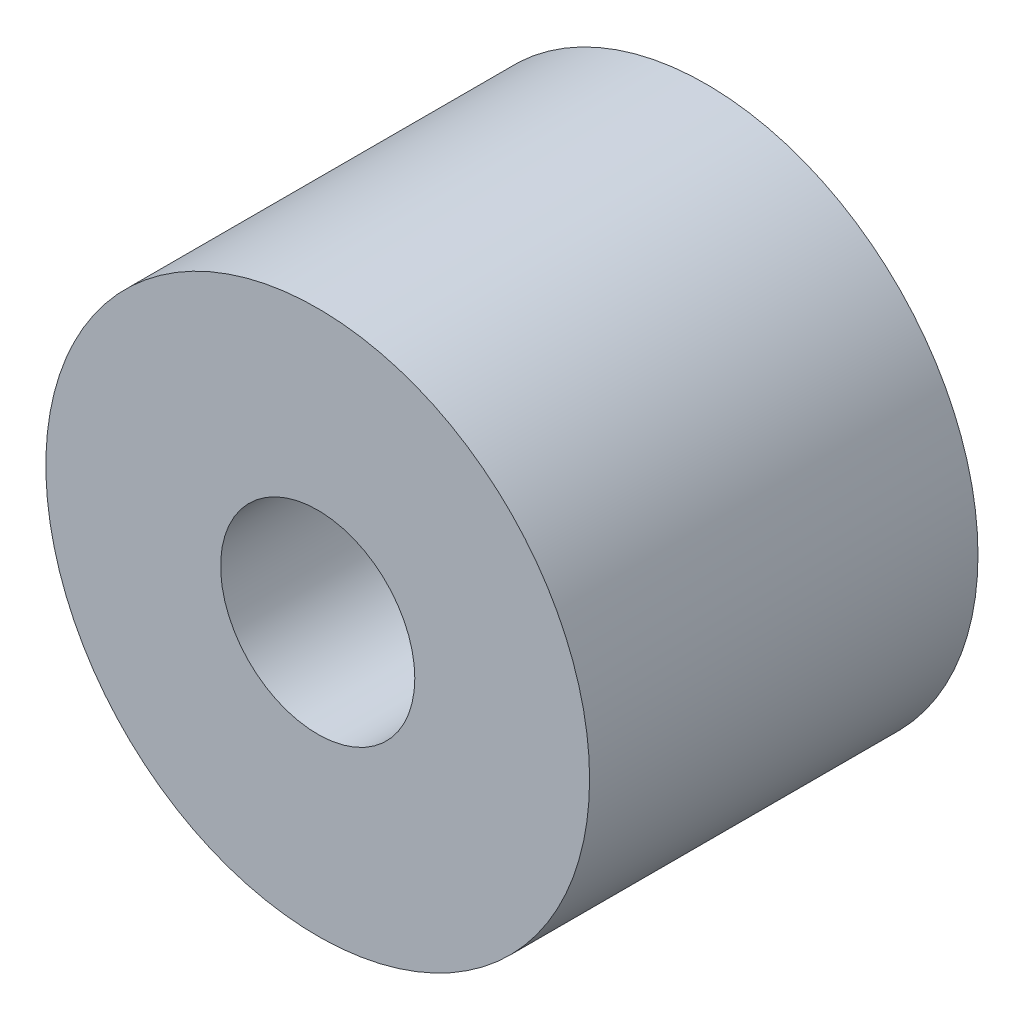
ISO-10303-21;
HEADER;
FILE_DESCRIPTION(('STEP AP214'),'2;1');
FILE_NAME('part.step','',(''),(''),'','','');
FILE_SCHEMA(('AUTOMOTIVE_DESIGN { 1 0 10303 214 1 1 1 1 }'));
ENDSEC;
DATA;
#1=APPLICATION_CONTEXT('core data for automotive mechanical design processes');
#2=APPLICATION_PROTOCOL_DEFINITION('international standard','automotive_design',2000,#1);
#3=PRODUCT_CONTEXT('',#1,'mechanical');
#4=PRODUCT('Part','Part','',(#3));
#5=PRODUCT_RELATED_PRODUCT_CATEGORY('part','',(#4));
#6=PRODUCT_DEFINITION_FORMATION('','',#4);
#7=PRODUCT_DEFINITION_CONTEXT('part definition',#1,'design');
#8=PRODUCT_DEFINITION('design','',#6,#7);
#9=PRODUCT_DEFINITION_SHAPE('','',#8);
#10=(LENGTH_UNIT() NAMED_UNIT(*) SI_UNIT(.MILLI.,.METRE.));
#11=(NAMED_UNIT(*) PLANE_ANGLE_UNIT() SI_UNIT($,.RADIAN.));
#12=(NAMED_UNIT(*) SI_UNIT($,.STERADIAN.) SOLID_ANGLE_UNIT());
#13=UNCERTAINTY_MEASURE_WITH_UNIT(LENGTH_MEASURE(1.E-05),#10,'distance_accuracy_value','');
#14=(GEOMETRIC_REPRESENTATION_CONTEXT(3) GLOBAL_UNCERTAINTY_ASSIGNED_CONTEXT((#13)) GLOBAL_UNIT_ASSIGNED_CONTEXT((#10,
#11,#12)) REPRESENTATION_CONTEXT('',''));
#15=CARTESIAN_POINT('',(0.,0.,0.));
#16=DIRECTION('',(0.,0.,1.));
#17=DIRECTION('',(1.,0.,0.));
#18=AXIS2_PLACEMENT_3D('',#15,#16,#17);
#19=CARTESIAN_POINT('',(0.,0.,6.35));
#20=DIRECTION('',(0.,0.,1.));
#21=DIRECTION('',(1.,0.,0.));
#22=AXIS2_PLACEMENT_3D('',#19,#20,#21);
#23=PLANE('',#22);
#24=CARTESIAN_POINT('',(0.,0.,6.35));
#25=DIRECTION('',(0.,0.,1.));
#26=DIRECTION('',(1.,0.,0.));
#27=AXIS2_PLACEMENT_3D('',#24,#25,#26);
#28=CIRCLE('',#27,4.445);
#29=CARTESIAN_POINT('',(4.445,0.,6.35));
#30=VERTEX_POINT('',#29);
#31=EDGE_CURVE('E10',#30,#30,#28,.T.);
#32=ORIENTED_EDGE('',*,*,#31,.T.);
#33=EDGE_LOOP('',(#32));
#34=FACE_BOUND('',#33,.T.);
#35=CARTESIAN_POINT('',(0.,0.,6.35));
#36=DIRECTION('',(0.,0.,1.));
#37=DIRECTION('',(1.,0.,0.));
#38=AXIS2_PLACEMENT_3D('',#35,#36,#37);
#39=CIRCLE('',#38,1.5875);
#40=CARTESIAN_POINT('',(1.5875,0.,6.35));
#41=VERTEX_POINT('',#40);
#42=EDGE_CURVE('E42',#41,#41,#39,.T.);
#43=ORIENTED_EDGE('',*,*,#42,.F.);
#44=EDGE_LOOP('',(#43));
#45=FACE_BOUND('',#44,.T.);
#46=ADVANCED_FACE('F31',(#34,#45),#23,.T.);
#47=CARTESIAN_POINT('',(0.,0.,0.));
#48=DIRECTION('',(0.,0.,1.));
#49=DIRECTION('',(1.,0.,0.));
#50=AXIS2_PLACEMENT_3D('',#47,#48,#49);
#51=PLANE('',#50);
#52=CARTESIAN_POINT('',(0.,0.,0.));
#53=DIRECTION('',(0.,0.,1.));
#54=DIRECTION('',(1.,0.,0.));
#55=AXIS2_PLACEMENT_3D('',#52,#53,#54);
#56=CIRCLE('',#55,4.445);
#57=CARTESIAN_POINT('',(4.445,0.,0.));
#58=VERTEX_POINT('',#57);
#59=EDGE_CURVE('E35',#58,#58,#56,.T.);
#60=ORIENTED_EDGE('',*,*,#59,.F.);
#61=EDGE_LOOP('',(#60));
#62=FACE_BOUND('',#61,.T.);
#63=CARTESIAN_POINT('',(0.,0.,0.));
#64=DIRECTION('',(0.,0.,1.));
#65=DIRECTION('',(1.,0.,0.));
#66=AXIS2_PLACEMENT_3D('',#63,#64,#65);
#67=CIRCLE('',#66,1.5875);
#68=CARTESIAN_POINT('',(1.5875,0.,0.));
#69=VERTEX_POINT('',#68);
#70=EDGE_CURVE('E44',#69,#69,#67,.T.);
#71=ORIENTED_EDGE('',*,*,#70,.T.);
#72=EDGE_LOOP('',(#71));
#73=FACE_BOUND('',#72,.T.);
#74=ADVANCED_FACE('F54',(#62,#73),#51,.F.);
#75=CARTESIAN_POINT('',(0.,0.,6.35));
#76=DIRECTION('',(0.,0.,-1.));
#77=DIRECTION('',(-1.,0.,0.));
#78=AXIS2_PLACEMENT_3D('',#75,#76,#77);
#79=CYLINDRICAL_SURFACE('',#78,4.445);
#80=ORIENTED_EDGE('',*,*,#31,.F.);
#81=EDGE_LOOP('',(#80));
#82=FACE_BOUND('',#81,.T.);
#83=ORIENTED_EDGE('',*,*,#59,.T.);
#84=EDGE_LOOP('',(#83));
#85=FACE_BOUND('',#84,.T.);
#86=ADVANCED_FACE('F33',(#82,#85),#79,.T.);
#87=CARTESIAN_POINT('',(0.,0.,6.35));
#88=DIRECTION('',(0.,0.,-1.));
#89=DIRECTION('',(-1.,0.,0.));
#90=AXIS2_PLACEMENT_3D('',#87,#88,#89);
#91=CYLINDRICAL_SURFACE('',#90,1.5875);
#92=ORIENTED_EDGE('',*,*,#42,.T.);
#93=EDGE_LOOP('',(#92));
#94=FACE_BOUND('',#93,.T.);
#95=ORIENTED_EDGE('',*,*,#70,.F.);
#96=EDGE_LOOP('',(#95));
#97=FACE_BOUND('',#96,.T.);
#98=ADVANCED_FACE('F50',(#94,#97),#91,.F.);
#99=CLOSED_SHELL('',(#46,#74,#86,#98));
#100=MANIFOLD_SOLID_BREP('B2',#99);
#101=ADVANCED_BREP_SHAPE_REPRESENTATION('',(#18,#100),#14);
#102=SHAPE_DEFINITION_REPRESENTATION(#9,#101);
ENDSEC;
END-ISO-10303-21;
